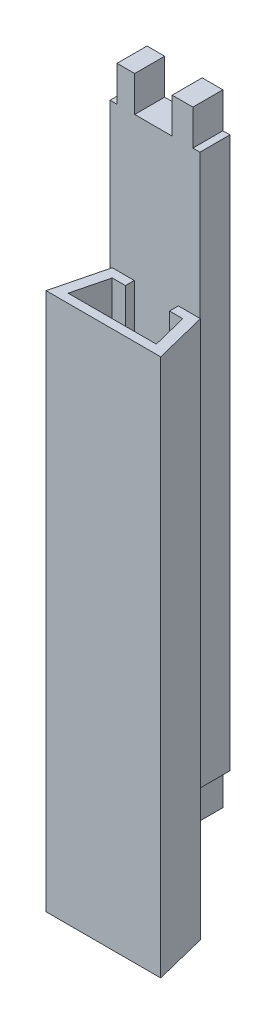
ISO-10303-21;
HEADER;
FILE_DESCRIPTION(('STEP AP214'),'2;1');
FILE_NAME('part.step','',(''),(''),'','','');
FILE_SCHEMA(('AUTOMOTIVE_DESIGN { 1 0 10303 214 1 1 1 1 }'));
ENDSEC;
DATA;
#1=APPLICATION_CONTEXT('core data for automotive mechanical design processes');
#2=APPLICATION_PROTOCOL_DEFINITION('international standard','automotive_design',2000,#1);
#3=PRODUCT_CONTEXT('',#1,'mechanical');
#4=PRODUCT('Part','Part','',(#3));
#5=PRODUCT_RELATED_PRODUCT_CATEGORY('part','',(#4));
#6=PRODUCT_DEFINITION_FORMATION('','',#4);
#7=PRODUCT_DEFINITION_CONTEXT('part definition',#1,'design');
#8=PRODUCT_DEFINITION('design','',#6,#7);
#9=PRODUCT_DEFINITION_SHAPE('','',#8);
#10=(LENGTH_UNIT() NAMED_UNIT(*) SI_UNIT(.MILLI.,.METRE.));
#11=(NAMED_UNIT(*) PLANE_ANGLE_UNIT() SI_UNIT($,.RADIAN.));
#12=(NAMED_UNIT(*) SI_UNIT($,.STERADIAN.) SOLID_ANGLE_UNIT());
#13=UNCERTAINTY_MEASURE_WITH_UNIT(LENGTH_MEASURE(1.E-05),#10,'distance_accuracy_value','');
#14=(GEOMETRIC_REPRESENTATION_CONTEXT(3) GLOBAL_UNCERTAINTY_ASSIGNED_CONTEXT((#13)) GLOBAL_UNIT_ASSIGNED_CONTEXT((#10,
#11,#12)) REPRESENTATION_CONTEXT('',''));
#15=CARTESIAN_POINT('',(0.,0.,0.));
#16=DIRECTION('',(0.,0.,1.));
#17=DIRECTION('',(1.,0.,0.));
#18=AXIS2_PLACEMENT_3D('',#15,#16,#17);
#19=CARTESIAN_POINT('',(-118.6,124.95,147.8));
#20=DIRECTION('',(0.,1.,0.));
#21=DIRECTION('',(0.,0.,1.));
#22=AXIS2_PLACEMENT_3D('',#19,#20,#21);
#23=PLANE('',#22);
#24=DIRECTION('',(1.,0.,0.));
#25=VECTOR('',#24,1.);
#26=CARTESIAN_POINT('',(-118.6,124.95,147.8));
#27=LINE('',#26,#25);
#28=CARTESIAN_POINT('',(-119.4,124.95,147.8));
#29=VERTEX_POINT('',#28);
#30=CARTESIAN_POINT('',(-117.8,124.95,147.8));
#31=VERTEX_POINT('',#30);
#32=EDGE_CURVE('P0_E20',#29,#31,#27,.T.);
#33=ORIENTED_EDGE('',*,*,#32,.T.);
#34=DIRECTION('',(0.,0.,-1.));
#35=VECTOR('',#34,1.);
#36=CARTESIAN_POINT('',(-117.8,124.95,147.8));
#37=LINE('',#36,#35);
#38=CARTESIAN_POINT('',(-117.8,124.95,141.));
#39=VERTEX_POINT('',#38);
#40=EDGE_CURVE('P0_E170',#39,#31,#37,.F.);
#41=ORIENTED_EDGE('',*,*,#40,.F.);
#42=DIRECTION('',(-1.,0.,0.));
#43=VECTOR('',#42,1.);
#44=CARTESIAN_POINT('',(-128.,124.95,141.));
#45=LINE('',#44,#43);
#46=CARTESIAN_POINT('',(-119.4,124.95,141.));
#47=VERTEX_POINT('',#46);
#48=EDGE_CURVE('P0_E151',#47,#39,#45,.F.);
#49=ORIENTED_EDGE('',*,*,#48,.F.);
#50=DIRECTION('',(0.,0.,-1.));
#51=VECTOR('',#50,1.);
#52=CARTESIAN_POINT('',(-119.4,124.95,147.8));
#53=LINE('',#52,#51);
#54=EDGE_CURVE('P0_E174',#29,#47,#53,.T.);
#55=ORIENTED_EDGE('',*,*,#54,.F.);
#56=EDGE_LOOP('',(#33,#41,#49,#55));
#57=FACE_BOUND('',#56,.T.);
#58=ADVANCED_FACE('P0_F17',(#57),#23,.T.);
#59=CARTESIAN_POINT('',(-118.6,0.0500000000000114,147.8));
#60=DIRECTION('',(0.,-1.,0.));
#61=DIRECTION('',(0.,0.,-1.));
#62=AXIS2_PLACEMENT_3D('',#59,#60,#61);
#63=PLANE('',#62);
#64=DIRECTION('',(1.,0.,0.));
#65=VECTOR('',#64,1.);
#66=CARTESIAN_POINT('',(-118.6,0.0500000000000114,147.8));
#67=LINE('',#66,#65);
#68=CARTESIAN_POINT('',(-117.8,0.0500000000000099,147.8));
#69=VERTEX_POINT('',#68);
#70=CARTESIAN_POINT('',(-119.4,0.0500000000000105,147.8));
#71=VERTEX_POINT('',#70);
#72=EDGE_CURVE('P0_E190',#69,#71,#67,.F.);
#73=ORIENTED_EDGE('',*,*,#72,.T.);
#74=DIRECTION('',(0.,0.,-1.));
#75=VECTOR('',#74,1.);
#76=CARTESIAN_POINT('',(-119.4,0.050000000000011,147.8));
#77=LINE('',#76,#75);
#78=CARTESIAN_POINT('',(-119.4,0.0500000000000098,141.));
#79=VERTEX_POINT('',#78);
#80=EDGE_CURVE('P0_E195',#79,#71,#77,.F.);
#81=ORIENTED_EDGE('',*,*,#80,.F.);
#82=DIRECTION('',(-1.,0.,0.));
#83=VECTOR('',#82,1.);
#84=CARTESIAN_POINT('',(-128.,0.0500000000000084,141.));
#85=LINE('',#84,#83);
#86=CARTESIAN_POINT('',(-117.8,0.0500000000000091,141.));
#87=VERTEX_POINT('',#86);
#88=EDGE_CURVE('P0_E162',#87,#79,#85,.T.);
#89=ORIENTED_EDGE('',*,*,#88,.F.);
#90=DIRECTION('',(0.,0.,-1.));
#91=VECTOR('',#90,1.);
#92=CARTESIAN_POINT('',(-117.8,0.0500000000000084,147.8));
#93=LINE('',#92,#91);
#94=EDGE_CURVE('P0_E173',#69,#87,#93,.T.);
#95=ORIENTED_EDGE('',*,*,#94,.F.);
#96=EDGE_LOOP('',(#73,#81,#89,#95));
#97=FACE_BOUND('',#96,.T.);
#98=ADVANCED_FACE('P0_F194',(#97),#63,.T.);
#99=CARTESIAN_POINT('',(-137.4,0.0500000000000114,147.8));
#100=DIRECTION('',(0.,-1.,0.));
#101=DIRECTION('',(0.,0.,-1.));
#102=AXIS2_PLACEMENT_3D('',#99,#100,#101);
#103=PLANE('',#102);
#104=DIRECTION('',(1.,0.,0.));
#105=VECTOR('',#104,1.);
#106=CARTESIAN_POINT('',(-137.4,0.0500000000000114,147.8));
#107=LINE('',#106,#105);
#108=CARTESIAN_POINT('',(-136.6,0.0500000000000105,147.8));
#109=VERTEX_POINT('',#108);
#110=CARTESIAN_POINT('',(-138.2,0.0500000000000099,147.8));
#111=VERTEX_POINT('',#110);
#112=EDGE_CURVE('P0_E189',#109,#111,#107,.F.);
#113=ORIENTED_EDGE('',*,*,#112,.T.);
#114=DIRECTION('',(0.,0.,1.));
#115=VECTOR('',#114,1.);
#116=CARTESIAN_POINT('',(-138.2,0.0500000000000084,147.8));
#117=LINE('',#116,#115);
#118=CARTESIAN_POINT('',(-138.2,0.0500000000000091,141.));
#119=VERTEX_POINT('',#118);
#120=EDGE_CURVE('P0_E254',#119,#111,#117,.T.);
#121=ORIENTED_EDGE('',*,*,#120,.F.);
#122=DIRECTION('',(-1.,0.,0.));
#123=VECTOR('',#122,1.);
#124=CARTESIAN_POINT('',(-128.,0.0500000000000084,141.));
#125=LINE('',#124,#123);
#126=CARTESIAN_POINT('',(-136.6,0.0500000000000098,141.));
#127=VERTEX_POINT('',#126);
#128=EDGE_CURVE('P0_E185',#127,#119,#125,.T.);
#129=ORIENTED_EDGE('',*,*,#128,.F.);
#130=DIRECTION('',(0.,0.,1.));
#131=VECTOR('',#130,1.);
#132=CARTESIAN_POINT('',(-136.6,0.050000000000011,147.8));
#133=LINE('',#132,#131);
#134=EDGE_CURVE('P0_E260',#109,#127,#133,.F.);
#135=ORIENTED_EDGE('',*,*,#134,.F.);
#136=EDGE_LOOP('',(#113,#121,#129,#135));
#137=FACE_BOUND('',#136,.T.);
#138=ADVANCED_FACE('P0_F362',(#137),#103,.T.);
#139=CARTESIAN_POINT('',(-137.4,124.95,147.8));
#140=DIRECTION('',(0.,1.,0.));
#141=DIRECTION('',(0.,0.,1.));
#142=AXIS2_PLACEMENT_3D('',#139,#140,#141);
#143=PLANE('',#142);
#144=DIRECTION('',(1.,0.,0.));
#145=VECTOR('',#144,1.);
#146=CARTESIAN_POINT('',(-137.4,124.95,147.8));
#147=LINE('',#146,#145);
#148=CARTESIAN_POINT('',(-138.2,124.95,147.8));
#149=VERTEX_POINT('',#148);
#150=CARTESIAN_POINT('',(-136.6,124.95,147.8));
#151=VERTEX_POINT('',#150);
#152=EDGE_CURVE('P0_E163',#149,#151,#147,.T.);
#153=ORIENTED_EDGE('',*,*,#152,.T.);
#154=DIRECTION('',(0.,0.,1.));
#155=VECTOR('',#154,1.);
#156=CARTESIAN_POINT('',(-136.6,124.95,147.8));
#157=LINE('',#156,#155);
#158=CARTESIAN_POINT('',(-136.6,124.95,141.));
#159=VERTEX_POINT('',#158);
#160=EDGE_CURVE('P0_E245',#159,#151,#157,.T.);
#161=ORIENTED_EDGE('',*,*,#160,.F.);
#162=DIRECTION('',(-1.,0.,0.));
#163=VECTOR('',#162,1.);
#164=CARTESIAN_POINT('',(-128.,124.95,141.));
#165=LINE('',#164,#163);
#166=CARTESIAN_POINT('',(-138.2,124.95,141.));
#167=VERTEX_POINT('',#166);
#168=EDGE_CURVE('P0_E183',#167,#159,#165,.F.);
#169=ORIENTED_EDGE('',*,*,#168,.F.);
#170=DIRECTION('',(0.,0.,1.));
#171=VECTOR('',#170,1.);
#172=CARTESIAN_POINT('',(-138.2,124.95,147.8));
#173=LINE('',#172,#171);
#174=EDGE_CURVE('P0_E251',#149,#167,#173,.F.);
#175=ORIENTED_EDGE('',*,*,#174,.F.);
#176=EDGE_LOOP('',(#153,#161,#169,#175));
#177=FACE_BOUND('',#176,.T.);
#178=ADVANCED_FACE('P0_F356',(#177),#143,.T.);
#179=CARTESIAN_POINT('',(-128.,62.5,141.));
#180=DIRECTION('',(0.,0.,-1.));
#181=DIRECTION('',(-1.,0.,0.));
#182=AXIS2_PLACEMENT_3D('',#179,#180,#181);
#183=PLANE('',#182);
#184=DIRECTION('',(0.,1.,0.));
#185=VECTOR('',#184,1.);
#186=CARTESIAN_POINT('',(-132.6,128.975,141.));
#187=LINE('',#186,#185);
#188=CARTESIAN_POINT('',(-132.6,124.95,141.));
#189=VERTEX_POINT('',#188);
#190=CARTESIAN_POINT('',(-132.6,133.,141.));
#191=VERTEX_POINT('',#190);
#192=EDGE_CURVE('P0_E239',#189,#191,#187,.T.);
#193=ORIENTED_EDGE('',*,*,#192,.F.);
#194=DIRECTION('',(1.,0.,0.));
#195=VECTOR('',#194,1.);
#196=CARTESIAN_POINT('',(-128.35,124.95,141.));
#197=LINE('',#196,#195);
#198=CARTESIAN_POINT('',(-124.1,124.95,141.));
#199=VERTEX_POINT('',#198);
#200=EDGE_CURVE('P0_E235',#199,#189,#197,.F.);
#201=ORIENTED_EDGE('',*,*,#200,.F.);
#202=DIRECTION('',(0.,1.,0.));
#203=VECTOR('',#202,1.);
#204=CARTESIAN_POINT('',(-124.1,128.975,141.));
#205=LINE('',#204,#203);
#206=CARTESIAN_POINT('',(-124.1,133.,141.));
#207=VERTEX_POINT('',#206);
#208=EDGE_CURVE('P0_E231',#207,#199,#205,.F.);
#209=ORIENTED_EDGE('',*,*,#208,.F.);
#210=DIRECTION('',(1.,0.,0.));
#211=VECTOR('',#210,1.);
#212=CARTESIAN_POINT('',(-121.75,133.,141.));
#213=LINE('',#212,#211);
#214=CARTESIAN_POINT('',(-119.4,133.,141.));
#215=VERTEX_POINT('',#214);
#216=EDGE_CURVE('P0_E227',#215,#207,#213,.F.);
#217=ORIENTED_EDGE('',*,*,#216,.F.);
#218=DIRECTION('',(0.,1.,0.));
#219=VECTOR('',#218,1.);
#220=CARTESIAN_POINT('',(-119.4,128.975,141.));
#221=LINE('',#220,#219);
#222=EDGE_CURVE('P0_E157',#47,#215,#221,.T.);
#223=ORIENTED_EDGE('',*,*,#222,.F.);
#224=ORIENTED_EDGE('',*,*,#48,.T.);
#225=DIRECTION('',(0.,1.,0.));
#226=VECTOR('',#225,1.);
#227=CARTESIAN_POINT('',(-117.8,62.5,141.));
#228=LINE('',#227,#226);
#229=EDGE_CURVE('P0_E155',#87,#39,#228,.T.);
#230=ORIENTED_EDGE('',*,*,#229,.F.);
#231=ORIENTED_EDGE('',*,*,#88,.T.);
#232=DIRECTION('',(0.,1.,0.));
#233=VECTOR('',#232,1.);
#234=CARTESIAN_POINT('',(-119.4,-3.97499999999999,141.));
#235=LINE('',#234,#233);
#236=CARTESIAN_POINT('',(-119.4,-8.,141.));
#237=VERTEX_POINT('',#236);
#238=EDGE_CURVE('P0_E177',#237,#79,#235,.T.);
#239=ORIENTED_EDGE('',*,*,#238,.F.);
#240=DIRECTION('',(1.,0.,0.));
#241=VECTOR('',#240,1.);
#242=CARTESIAN_POINT('',(-121.4,-8.,141.));
#243=LINE('',#242,#241);
#244=CARTESIAN_POINT('',(-123.4,-8.,141.));
#245=VERTEX_POINT('',#244);
#246=EDGE_CURVE('P0_E205',#245,#237,#243,.T.);
#247=ORIENTED_EDGE('',*,*,#246,.F.);
#248=DIRECTION('',(0.,1.,0.));
#249=VECTOR('',#248,1.);
#250=CARTESIAN_POINT('',(-123.4,-3.97499999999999,141.));
#251=LINE('',#250,#249);
#252=CARTESIAN_POINT('',(-123.4,0.0500000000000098,141.));
#253=VERTEX_POINT('',#252);
#254=EDGE_CURVE('P0_E281',#253,#245,#251,.F.);
#255=ORIENTED_EDGE('',*,*,#254,.F.);
#256=DIRECTION('',(1.,0.,0.));
#257=VECTOR('',#256,1.);
#258=CARTESIAN_POINT('',(-127.65,0.0500000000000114,141.));
#259=LINE('',#258,#257);
#260=CARTESIAN_POINT('',(-131.9,0.0500000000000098,141.));
#261=VERTEX_POINT('',#260);
#262=EDGE_CURVE('P0_E277',#261,#253,#259,.T.);
#263=ORIENTED_EDGE('',*,*,#262,.F.);
#264=DIRECTION('',(0.,1.,0.));
#265=VECTOR('',#264,1.);
#266=CARTESIAN_POINT('',(-131.9,-3.97499999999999,141.));
#267=LINE('',#266,#265);
#268=CARTESIAN_POINT('',(-131.9,-8.,141.));
#269=VERTEX_POINT('',#268);
#270=EDGE_CURVE('P0_E273',#269,#261,#267,.T.);
#271=ORIENTED_EDGE('',*,*,#270,.F.);
#272=DIRECTION('',(1.,0.,0.));
#273=VECTOR('',#272,1.);
#274=CARTESIAN_POINT('',(-134.25,-8.,141.));
#275=LINE('',#274,#273);
#276=CARTESIAN_POINT('',(-136.6,-8.,141.));
#277=VERTEX_POINT('',#276);
#278=EDGE_CURVE('P0_E269',#277,#269,#275,.T.);
#279=ORIENTED_EDGE('',*,*,#278,.F.);
#280=DIRECTION('',(0.,1.,0.));
#281=VECTOR('',#280,1.);
#282=CARTESIAN_POINT('',(-136.6,-3.97499999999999,141.));
#283=LINE('',#282,#281);
#284=EDGE_CURVE('P0_E265',#127,#277,#283,.F.);
#285=ORIENTED_EDGE('',*,*,#284,.F.);
#286=ORIENTED_EDGE('',*,*,#128,.T.);
#287=DIRECTION('',(0.,1.,0.));
#288=VECTOR('',#287,1.);
#289=CARTESIAN_POINT('',(-138.2,62.5,141.));
#290=LINE('',#289,#288);
#291=EDGE_CURVE('P0_E257',#167,#119,#290,.F.);
#292=ORIENTED_EDGE('',*,*,#291,.F.);
#293=ORIENTED_EDGE('',*,*,#168,.T.);
#294=DIRECTION('',(0.,1.,0.));
#295=VECTOR('',#294,1.);
#296=CARTESIAN_POINT('',(-136.6,128.975,141.));
#297=LINE('',#296,#295);
#298=CARTESIAN_POINT('',(-136.6,133.,141.));
#299=VERTEX_POINT('',#298);
#300=EDGE_CURVE('P0_E248',#299,#159,#297,.F.);
#301=ORIENTED_EDGE('',*,*,#300,.F.);
#302=DIRECTION('',(1.,0.,0.));
#303=VECTOR('',#302,1.);
#304=CARTESIAN_POINT('',(-134.6,133.,141.));
#305=LINE('',#304,#303);
#306=EDGE_CURVE('P0_E243',#191,#299,#305,.F.);
#307=ORIENTED_EDGE('',*,*,#306,.F.);
#308=EDGE_LOOP('',(#193,#201,#209,#217,#223,#224,#230,#231,#239,#247,#255,#263,#271,#279,#285,
#286,#292,#293,#301,#307));
#309=FACE_BOUND('',#308,.T.);
#310=ADVANCED_FACE('P0_F154',(#309),#183,.T.);
#311=CARTESIAN_POINT('',(-119.4,128.975,147.8));
#312=DIRECTION('',(1.,0.,0.));
#313=DIRECTION('',(0.,0.,-1.));
#314=AXIS2_PLACEMENT_3D('',#311,#312,#313);
#315=PLANE('',#314);
#316=DIRECTION('',(0.,1.,0.));
#317=VECTOR('',#316,1.);
#318=CARTESIAN_POINT('',(-119.4,62.5,147.8));
#319=LINE('',#318,#317);
#320=CARTESIAN_POINT('',(-119.4,133.,147.8));
#321=VERTEX_POINT('',#320);
#322=EDGE_CURVE('P0_E217',#321,#29,#319,.F.);
#323=ORIENTED_EDGE('',*,*,#322,.T.);
#324=ORIENTED_EDGE('',*,*,#54,.T.);
#325=ORIENTED_EDGE('',*,*,#222,.T.);
#326=DIRECTION('',(0.,0.,1.));
#327=VECTOR('',#326,1.);
#328=CARTESIAN_POINT('',(-119.4,133.,147.8));
#329=LINE('',#328,#327);
#330=EDGE_CURVE('P0_E223',#321,#215,#329,.F.);
#331=ORIENTED_EDGE('',*,*,#330,.F.);
#332=EDGE_LOOP('',(#323,#324,#325,#331));
#333=FACE_BOUND('',#332,.T.);
#334=ADVANCED_FACE('P0_F504',(#333),#315,.T.);
#335=CARTESIAN_POINT('',(-117.8,62.5,147.8));
#336=DIRECTION('',(1.,0.,0.));
#337=DIRECTION('',(0.,0.,-1.));
#338=AXIS2_PLACEMENT_3D('',#335,#336,#337);
#339=PLANE('',#338);
#340=DIRECTION('',(0.,1.,0.));
#341=VECTOR('',#340,1.);
#342=CARTESIAN_POINT('',(-117.8,62.5,147.8));
#343=LINE('',#342,#341);
#344=EDGE_CURVE('P0_E213',#31,#69,#343,.F.);
#345=ORIENTED_EDGE('',*,*,#344,.T.);
#346=ORIENTED_EDGE('',*,*,#94,.T.);
#347=ORIENTED_EDGE('',*,*,#229,.T.);
#348=ORIENTED_EDGE('',*,*,#40,.T.);
#349=EDGE_LOOP('',(#345,#346,#347,#348));
#350=FACE_BOUND('',#349,.T.);
#351=ADVANCED_FACE('P0_F169',(#350),#339,.T.);
#352=CARTESIAN_POINT('',(-119.4,-3.97499999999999,147.8));
#353=DIRECTION('',(1.,0.,0.));
#354=DIRECTION('',(0.,0.,-1.));
#355=AXIS2_PLACEMENT_3D('',#352,#353,#354);
#356=PLANE('',#355);
#357=DIRECTION('',(0.,1.,0.));
#358=VECTOR('',#357,1.);
#359=CARTESIAN_POINT('',(-119.4,62.5,147.8));
#360=LINE('',#359,#358);
#361=CARTESIAN_POINT('',(-119.4,-8.,147.8));
#362=VERTEX_POINT('',#361);
#363=EDGE_CURVE('P0_E203',#71,#362,#360,.F.);
#364=ORIENTED_EDGE('',*,*,#363,.T.);
#365=DIRECTION('',(0.,0.,-1.));
#366=VECTOR('',#365,1.);
#367=CARTESIAN_POINT('',(-119.4,-8.,147.8));
#368=LINE('',#367,#366);
#369=EDGE_CURVE('P0_E283',#237,#362,#368,.F.);
#370=ORIENTED_EDGE('',*,*,#369,.F.);
#371=ORIENTED_EDGE('',*,*,#238,.T.);
#372=ORIENTED_EDGE('',*,*,#80,.T.);
#373=EDGE_LOOP('',(#364,#370,#371,#372));
#374=FACE_BOUND('',#373,.T.);
#375=ADVANCED_FACE('P0_F201',(#374),#356,.T.);
#376=CARTESIAN_POINT('',(-121.4,-8.,147.8));
#377=DIRECTION('',(0.,-1.,0.));
#378=DIRECTION('',(0.,0.,-1.));
#379=AXIS2_PLACEMENT_3D('',#376,#377,#378);
#380=PLANE('',#379);
#381=DIRECTION('',(-1.,0.,0.));
#382=VECTOR('',#381,1.);
#383=CARTESIAN_POINT('',(-128.,-8.00000000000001,147.8));
#384=LINE('',#383,#382);
#385=CARTESIAN_POINT('',(-123.4,-8.,147.8));
#386=VERTEX_POINT('',#385);
#387=EDGE_CURVE('P0_E212',#362,#386,#384,.T.);
#388=ORIENTED_EDGE('',*,*,#387,.T.);
#389=DIRECTION('',(0.,0.,1.));
#390=VECTOR('',#389,1.);
#391=CARTESIAN_POINT('',(-123.4,-8.,147.8));
#392=LINE('',#391,#390);
#393=EDGE_CURVE('P0_E279',#245,#386,#392,.T.);
#394=ORIENTED_EDGE('',*,*,#393,.F.);
#395=ORIENTED_EDGE('',*,*,#246,.T.);
#396=ORIENTED_EDGE('',*,*,#369,.T.);
#397=EDGE_LOOP('',(#388,#394,#395,#396));
#398=FACE_BOUND('',#397,.T.);
#399=ADVANCED_FACE('P0_F288',(#398),#380,.T.);
#400=CARTESIAN_POINT('',(-123.4,-3.97499999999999,147.8));
#401=DIRECTION('',(-1.,0.,0.));
#402=DIRECTION('',(0.,0.,1.));
#403=AXIS2_PLACEMENT_3D('',#400,#401,#402);
#404=PLANE('',#403);
#405=DIRECTION('',(0.,1.,0.));
#406=VECTOR('',#405,1.);
#407=CARTESIAN_POINT('',(-123.4,62.5,147.8));
#408=LINE('',#407,#406);
#409=CARTESIAN_POINT('',(-123.4,0.0500000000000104,147.8));
#410=VERTEX_POINT('',#409);
#411=EDGE_CURVE('P0_E215',#386,#410,#408,.T.);
#412=ORIENTED_EDGE('',*,*,#411,.T.);
#413=DIRECTION('',(0.,0.,-1.));
#414=VECTOR('',#413,1.);
#415=CARTESIAN_POINT('',(-123.4,0.0500000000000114,147.8));
#416=LINE('',#415,#414);
#417=EDGE_CURVE('P0_E275',#253,#410,#416,.F.);
#418=ORIENTED_EDGE('',*,*,#417,.F.);
#419=ORIENTED_EDGE('',*,*,#254,.T.);
#420=ORIENTED_EDGE('',*,*,#393,.T.);
#421=EDGE_LOOP('',(#412,#418,#419,#420));
#422=FACE_BOUND('',#421,.T.);
#423=ADVANCED_FACE('P0_F296',(#422),#404,.T.);
#424=CARTESIAN_POINT('',(-127.65,0.0500000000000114,147.8));
#425=DIRECTION('',(0.,-1.,0.));
#426=DIRECTION('',(0.,0.,-1.));
#427=AXIS2_PLACEMENT_3D('',#424,#425,#426);
#428=PLANE('',#427);
#429=DIRECTION('',(-1.,0.,0.));
#430=VECTOR('',#429,1.);
#431=CARTESIAN_POINT('',(-128.,0.0500000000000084,147.8));
#432=LINE('',#431,#430);
#433=CARTESIAN_POINT('',(-131.9,0.0500000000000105,147.8));
#434=VERTEX_POINT('',#433);
#435=EDGE_CURVE('P0_E301',#410,#434,#432,.T.);
#436=ORIENTED_EDGE('',*,*,#435,.T.);
#437=DIRECTION('',(0.,0.,-1.));
#438=VECTOR('',#437,1.);
#439=CARTESIAN_POINT('',(-131.9,0.050000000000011,147.8));
#440=LINE('',#439,#438);
#441=EDGE_CURVE('P0_E271',#261,#434,#440,.F.);
#442=ORIENTED_EDGE('',*,*,#441,.F.);
#443=ORIENTED_EDGE('',*,*,#262,.T.);
#444=ORIENTED_EDGE('',*,*,#417,.T.);
#445=EDGE_LOOP('',(#436,#442,#443,#444));
#446=FACE_BOUND('',#445,.T.);
#447=ADVANCED_FACE('P0_F300',(#446),#428,.T.);
#448=CARTESIAN_POINT('',(-131.9,-3.97499999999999,147.8));
#449=DIRECTION('',(1.,0.,0.));
#450=DIRECTION('',(0.,0.,-1.));
#451=AXIS2_PLACEMENT_3D('',#448,#449,#450);
#452=PLANE('',#451);
#453=DIRECTION('',(0.,1.,0.));
#454=VECTOR('',#453,1.);
#455=CARTESIAN_POINT('',(-131.9,62.5,147.8));
#456=LINE('',#455,#454);
#457=CARTESIAN_POINT('',(-131.9,-8.,147.8));
#458=VERTEX_POINT('',#457);
#459=EDGE_CURVE('P0_E305',#434,#458,#456,.F.);
#460=ORIENTED_EDGE('',*,*,#459,.T.);
#461=DIRECTION('',(0.,0.,-1.));
#462=VECTOR('',#461,1.);
#463=CARTESIAN_POINT('',(-131.9,-8.,147.8));
#464=LINE('',#463,#462);
#465=EDGE_CURVE('P0_E267',#269,#458,#464,.F.);
#466=ORIENTED_EDGE('',*,*,#465,.F.);
#467=ORIENTED_EDGE('',*,*,#270,.T.);
#468=ORIENTED_EDGE('',*,*,#441,.T.);
#469=EDGE_LOOP('',(#460,#466,#467,#468));
#470=FACE_BOUND('',#469,.T.);
#471=ADVANCED_FACE('P0_F372',(#470),#452,.T.);
#472=CARTESIAN_POINT('',(-134.25,-8.,147.8));
#473=DIRECTION('',(0.,-1.,0.));
#474=DIRECTION('',(0.,0.,-1.));
#475=AXIS2_PLACEMENT_3D('',#472,#473,#474);
#476=PLANE('',#475);
#477=DIRECTION('',(-1.,0.,0.));
#478=VECTOR('',#477,1.);
#479=CARTESIAN_POINT('',(-128.,-8.00000000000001,147.8));
#480=LINE('',#479,#478);
#481=CARTESIAN_POINT('',(-136.6,-8.,147.8));
#482=VERTEX_POINT('',#481);
#483=EDGE_CURVE('P0_E307',#458,#482,#480,.T.);
#484=ORIENTED_EDGE('',*,*,#483,.T.);
#485=DIRECTION('',(0.,0.,1.));
#486=VECTOR('',#485,1.);
#487=CARTESIAN_POINT('',(-136.6,-8.,147.8));
#488=LINE('',#487,#486);
#489=EDGE_CURVE('P0_E263',#277,#482,#488,.T.);
#490=ORIENTED_EDGE('',*,*,#489,.F.);
#491=ORIENTED_EDGE('',*,*,#278,.T.);
#492=ORIENTED_EDGE('',*,*,#465,.T.);
#493=EDGE_LOOP('',(#484,#490,#491,#492));
#494=FACE_BOUND('',#493,.T.);
#495=ADVANCED_FACE('P0_F368',(#494),#476,.T.);
#496=CARTESIAN_POINT('',(-136.6,-3.97499999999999,147.8));
#497=DIRECTION('',(-1.,0.,0.));
#498=DIRECTION('',(0.,0.,1.));
#499=AXIS2_PLACEMENT_3D('',#496,#497,#498);
#500=PLANE('',#499);
#501=DIRECTION('',(0.,1.,0.));
#502=VECTOR('',#501,1.);
#503=CARTESIAN_POINT('',(-136.6,62.5,147.8));
#504=LINE('',#503,#502);
#505=EDGE_CURVE('P0_E312',#482,#109,#504,.T.);
#506=ORIENTED_EDGE('',*,*,#505,.T.);
#507=ORIENTED_EDGE('',*,*,#134,.T.);
#508=ORIENTED_EDGE('',*,*,#284,.T.);
#509=ORIENTED_EDGE('',*,*,#489,.T.);
#510=EDGE_LOOP('',(#506,#507,#508,#509));
#511=FACE_BOUND('',#510,.T.);
#512=ADVANCED_FACE('P0_F374',(#511),#500,.T.);
#513=CARTESIAN_POINT('',(-138.2,62.5,147.8));
#514=DIRECTION('',(-1.,0.,0.));
#515=DIRECTION('',(0.,0.,1.));
#516=AXIS2_PLACEMENT_3D('',#513,#514,#515);
#517=PLANE('',#516);
#518=DIRECTION('',(0.,1.,0.));
#519=VECTOR('',#518,1.);
#520=CARTESIAN_POINT('',(-138.2,62.5,147.8));
#521=LINE('',#520,#519);
#522=EDGE_CURVE('P0_E315',#111,#149,#521,.T.);
#523=ORIENTED_EDGE('',*,*,#522,.T.);
#524=ORIENTED_EDGE('',*,*,#174,.T.);
#525=ORIENTED_EDGE('',*,*,#291,.T.);
#526=ORIENTED_EDGE('',*,*,#120,.T.);
#527=EDGE_LOOP('',(#523,#524,#525,#526));
#528=FACE_BOUND('',#527,.T.);
#529=ADVANCED_FACE('P0_F359',(#528),#517,.T.);
#530=CARTESIAN_POINT('',(-136.6,128.975,147.8));
#531=DIRECTION('',(-1.,0.,0.));
#532=DIRECTION('',(0.,0.,1.));
#533=AXIS2_PLACEMENT_3D('',#530,#531,#532);
#534=PLANE('',#533);
#535=DIRECTION('',(0.,1.,0.));
#536=VECTOR('',#535,1.);
#537=CARTESIAN_POINT('',(-136.6,62.5,147.8));
#538=LINE('',#537,#536);
#539=CARTESIAN_POINT('',(-136.6,133.,147.8));
#540=VERTEX_POINT('',#539);
#541=EDGE_CURVE('P0_E318',#151,#540,#538,.T.);
#542=ORIENTED_EDGE('',*,*,#541,.T.);
#543=DIRECTION('',(0.,0.,1.));
#544=VECTOR('',#543,1.);
#545=CARTESIAN_POINT('',(-136.6,133.,147.8));
#546=LINE('',#545,#544);
#547=EDGE_CURVE('P0_E241',#299,#540,#546,.T.);
#548=ORIENTED_EDGE('',*,*,#547,.F.);
#549=ORIENTED_EDGE('',*,*,#300,.T.);
#550=ORIENTED_EDGE('',*,*,#160,.T.);
#551=EDGE_LOOP('',(#542,#548,#549,#550));
#552=FACE_BOUND('',#551,.T.);
#553=ADVANCED_FACE('P0_F351',(#552),#534,.T.);
#554=CARTESIAN_POINT('',(-134.6,133.,147.8));
#555=DIRECTION('',(0.,1.,0.));
#556=DIRECTION('',(0.,0.,1.));
#557=AXIS2_PLACEMENT_3D('',#554,#555,#556);
#558=PLANE('',#557);
#559=DIRECTION('',(-1.,0.,0.));
#560=VECTOR('',#559,1.);
#561=CARTESIAN_POINT('',(-128.,133.,147.8));
#562=LINE('',#561,#560);
#563=CARTESIAN_POINT('',(-132.6,133.,147.8));
#564=VERTEX_POINT('',#563);
#565=EDGE_CURVE('P0_E321',#540,#564,#562,.F.);
#566=ORIENTED_EDGE('',*,*,#565,.T.);
#567=DIRECTION('',(0.,0.,-1.));
#568=VECTOR('',#567,1.);
#569=CARTESIAN_POINT('',(-132.6,133.,147.8));
#570=LINE('',#569,#568);
#571=EDGE_CURVE('P0_E237',#191,#564,#570,.F.);
#572=ORIENTED_EDGE('',*,*,#571,.F.);
#573=ORIENTED_EDGE('',*,*,#306,.T.);
#574=ORIENTED_EDGE('',*,*,#547,.T.);
#575=EDGE_LOOP('',(#566,#572,#573,#574));
#576=FACE_BOUND('',#575,.T.);
#577=ADVANCED_FACE('P0_F347',(#576),#558,.T.);
#578=CARTESIAN_POINT('',(-132.6,128.975,147.8));
#579=DIRECTION('',(1.,0.,0.));
#580=DIRECTION('',(0.,0.,-1.));
#581=AXIS2_PLACEMENT_3D('',#578,#579,#580);
#582=PLANE('',#581);
#583=DIRECTION('',(0.,1.,0.));
#584=VECTOR('',#583,1.);
#585=CARTESIAN_POINT('',(-132.6,62.5,147.8));
#586=LINE('',#585,#584);
#587=CARTESIAN_POINT('',(-132.6,124.95,147.8));
#588=VERTEX_POINT('',#587);
#589=EDGE_CURVE('P0_E324',#564,#588,#586,.F.);
#590=ORIENTED_EDGE('',*,*,#589,.T.);
#591=DIRECTION('',(0.,0.,1.));
#592=VECTOR('',#591,1.);
#593=CARTESIAN_POINT('',(-132.6,124.95,147.8));
#594=LINE('',#593,#592);
#595=EDGE_CURVE('P0_E233',#189,#588,#594,.T.);
#596=ORIENTED_EDGE('',*,*,#595,.F.);
#597=ORIENTED_EDGE('',*,*,#192,.T.);
#598=ORIENTED_EDGE('',*,*,#571,.T.);
#599=EDGE_LOOP('',(#590,#596,#597,#598));
#600=FACE_BOUND('',#599,.T.);
#601=ADVANCED_FACE('P0_F341',(#600),#582,.T.);
#602=CARTESIAN_POINT('',(-128.35,124.95,147.8));
#603=DIRECTION('',(0.,1.,0.));
#604=DIRECTION('',(0.,0.,1.));
#605=AXIS2_PLACEMENT_3D('',#602,#603,#604);
#606=PLANE('',#605);
#607=DIRECTION('',(-1.,0.,0.));
#608=VECTOR('',#607,1.);
#609=CARTESIAN_POINT('',(-128.,124.95,147.8));
#610=LINE('',#609,#608);
#611=CARTESIAN_POINT('',(-124.1,124.95,147.8));
#612=VERTEX_POINT('',#611);
#613=EDGE_CURVE('P0_E327',#588,#612,#610,.F.);
#614=ORIENTED_EDGE('',*,*,#613,.T.);
#615=DIRECTION('',(0.,0.,1.));
#616=VECTOR('',#615,1.);
#617=CARTESIAN_POINT('',(-124.1,124.95,147.8));
#618=LINE('',#617,#616);
#619=EDGE_CURVE('P0_E229',#199,#612,#618,.T.);
#620=ORIENTED_EDGE('',*,*,#619,.F.);
#621=ORIENTED_EDGE('',*,*,#200,.T.);
#622=ORIENTED_EDGE('',*,*,#595,.T.);
#623=EDGE_LOOP('',(#614,#620,#621,#622));
#624=FACE_BOUND('',#623,.T.);
#625=ADVANCED_FACE('P0_F337',(#624),#606,.T.);
#626=CARTESIAN_POINT('',(-124.1,128.975,147.8));
#627=DIRECTION('',(-1.,0.,0.));
#628=DIRECTION('',(0.,0.,1.));
#629=AXIS2_PLACEMENT_3D('',#626,#627,#628);
#630=PLANE('',#629);
#631=DIRECTION('',(0.,1.,0.));
#632=VECTOR('',#631,1.);
#633=CARTESIAN_POINT('',(-124.1,62.5,147.8));
#634=LINE('',#633,#632);
#635=CARTESIAN_POINT('',(-124.1,133.,147.8));
#636=VERTEX_POINT('',#635);
#637=EDGE_CURVE('P0_E26',#612,#636,#634,.T.);
#638=ORIENTED_EDGE('',*,*,#637,.T.);
#639=DIRECTION('',(0.,0.,1.));
#640=VECTOR('',#639,1.);
#641=CARTESIAN_POINT('',(-124.1,133.,147.8));
#642=LINE('',#641,#640);
#643=EDGE_CURVE('P0_E34',#207,#636,#642,.T.);
#644=ORIENTED_EDGE('',*,*,#643,.F.);
#645=ORIENTED_EDGE('',*,*,#208,.T.);
#646=ORIENTED_EDGE('',*,*,#619,.T.);
#647=EDGE_LOOP('',(#638,#644,#645,#646));
#648=FACE_BOUND('',#647,.T.);
#649=ADVANCED_FACE('P0_F332',(#648),#630,.T.);
#650=CARTESIAN_POINT('',(-121.75,133.,147.8));
#651=DIRECTION('',(0.,1.,0.));
#652=DIRECTION('',(0.,0.,1.));
#653=AXIS2_PLACEMENT_3D('',#650,#651,#652);
#654=PLANE('',#653);
#655=DIRECTION('',(-1.,0.,0.));
#656=VECTOR('',#655,1.);
#657=CARTESIAN_POINT('',(-128.,133.,147.8));
#658=LINE('',#657,#656);
#659=EDGE_CURVE('P0_E11',#636,#321,#658,.F.);
#660=ORIENTED_EDGE('',*,*,#659,.T.);
#661=ORIENTED_EDGE('',*,*,#330,.T.);
#662=ORIENTED_EDGE('',*,*,#216,.T.);
#663=ORIENTED_EDGE('',*,*,#643,.T.);
#664=EDGE_LOOP('',(#660,#661,#662,#663));
#665=FACE_BOUND('',#664,.T.);
#666=ADVANCED_FACE('P0_F385',(#665),#654,.T.);
#667=CARTESIAN_POINT('',(-128.,62.5,147.8));
#668=DIRECTION('',(0.,0.,-1.));
#669=DIRECTION('',(-1.,0.,0.));
#670=AXIS2_PLACEMENT_3D('',#667,#668,#669);
#671=PLANE('',#670);
#672=ORIENTED_EDGE('',*,*,#637,.F.);
#673=ORIENTED_EDGE('',*,*,#613,.F.);
#674=ORIENTED_EDGE('',*,*,#589,.F.);
#675=ORIENTED_EDGE('',*,*,#565,.F.);
#676=ORIENTED_EDGE('',*,*,#541,.F.);
#677=ORIENTED_EDGE('',*,*,#152,.F.);
#678=ORIENTED_EDGE('',*,*,#522,.F.);
#679=ORIENTED_EDGE('',*,*,#112,.F.);
#680=ORIENTED_EDGE('',*,*,#505,.F.);
#681=ORIENTED_EDGE('',*,*,#483,.F.);
#682=ORIENTED_EDGE('',*,*,#459,.F.);
#683=ORIENTED_EDGE('',*,*,#435,.F.);
#684=ORIENTED_EDGE('',*,*,#411,.F.);
#685=ORIENTED_EDGE('',*,*,#387,.F.);
#686=ORIENTED_EDGE('',*,*,#363,.F.);
#687=ORIENTED_EDGE('',*,*,#72,.F.);
#688=ORIENTED_EDGE('',*,*,#344,.F.);
#689=ORIENTED_EDGE('',*,*,#32,.F.);
#690=ORIENTED_EDGE('',*,*,#322,.F.);
#691=ORIENTED_EDGE('',*,*,#659,.F.);
#692=EDGE_LOOP('',(#672,#673,#674,#675,#676,#677,#678,#679,#680,#681,#682,#683,#684,#685,#686,
#687,#688,#689,#690,#691));
#693=FACE_BOUND('',#692,.T.);
#694=ADVANCED_FACE('P0_F209',(#693),#671,.F.);
#695=CLOSED_SHELL('',(#58,#98,#138,#178,#310,#334,#351,#375,#399,#423,#447,#471,#495,#512,#529,
#553,#577,#601,#625,#649,#666,#694));
#696=MANIFOLD_SOLID_BREP('P0_B1',#695);
#697=CARTESIAN_POINT('',(-101.5,123.5,179.999));
#698=DIRECTION('',(1.,0.,0.));
#699=DIRECTION('',(0.,0.,-1.));
#700=AXIS2_PLACEMENT_3D('',#697,#698,#699);
#701=PLANE('',#700);
#702=DIRECTION('',(0.,0.,-1.));
#703=VECTOR('',#702,1.);
#704=CARTESIAN_POINT('',(-101.5,123.5,186.229986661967));
#705=LINE('',#704,#703);
#706=CARTESIAN_POINT('',(-101.5,123.5,178.999));
#707=VERTEX_POINT('',#706);
#708=CARTESIAN_POINT('',(-101.5,123.5,180.999));
#709=VERTEX_POINT('',#708);
#710=EDGE_CURVE('P1_E155',#707,#709,#705,.F.);
#711=ORIENTED_EDGE('',*,*,#710,.T.);
#712=DIRECTION('',(0.,1.,0.));
#713=VECTOR('',#712,1.);
#714=CARTESIAN_POINT('',(-101.5,123.5,180.999));
#715=LINE('',#714,#713);
#716=CARTESIAN_POINT('',(-101.5,1.5,180.999));
#717=VERTEX_POINT('',#716);
#718=EDGE_CURVE('P1_E20',#717,#709,#715,.T.);
#719=ORIENTED_EDGE('',*,*,#718,.F.);
#720=DIRECTION('',(0.,0.,-1.));
#721=VECTOR('',#720,1.);
#722=CARTESIAN_POINT('',(-101.5,1.5,186.229986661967));
#723=LINE('',#722,#721);
#724=CARTESIAN_POINT('',(-101.5,1.5,178.999));
#725=VERTEX_POINT('',#724);
#726=EDGE_CURVE('P1_E118',#725,#717,#723,.F.);
#727=ORIENTED_EDGE('',*,*,#726,.F.);
#728=DIRECTION('',(0.,1.,0.));
#729=VECTOR('',#728,1.);
#730=CARTESIAN_POINT('',(-101.5,123.5,178.999));
#731=LINE('',#730,#729);
#732=EDGE_CURVE('P1_E107',#707,#725,#731,.F.);
#733=ORIENTED_EDGE('',*,*,#732,.F.);
#734=EDGE_LOOP('',(#711,#719,#727,#733));
#735=FACE_BOUND('',#734,.T.);
#736=ADVANCED_FACE('P1_F17',(#735),#701,.T.);
#737=CARTESIAN_POINT('',(-103.,123.5,180.999));
#738=DIRECTION('',(0.,0.,1.));
#739=DIRECTION('',(1.,0.,0.));
#740=AXIS2_PLACEMENT_3D('',#737,#738,#739);
#741=PLANE('',#740);
#742=DIRECTION('',(1.,0.,0.));
#743=VECTOR('',#742,1.);
#744=CARTESIAN_POINT('',(-96.5,123.5,180.999));
#745=LINE('',#744,#743);
#746=CARTESIAN_POINT('',(-104.5,123.5,180.999));
#747=VERTEX_POINT('',#746);
#748=EDGE_CURVE('P1_E152',#709,#747,#745,.F.);
#749=ORIENTED_EDGE('',*,*,#748,.T.);
#750=DIRECTION('',(0.,1.,0.));
#751=VECTOR('',#750,1.);
#752=CARTESIAN_POINT('',(-104.5,123.5,180.999));
#753=LINE('',#752,#751);
#754=CARTESIAN_POINT('',(-104.5,1.5,180.999));
#755=VERTEX_POINT('',#754);
#756=EDGE_CURVE('P1_E144',#755,#747,#753,.T.);
#757=ORIENTED_EDGE('',*,*,#756,.F.);
#758=DIRECTION('',(1.,0.,0.));
#759=VECTOR('',#758,1.);
#760=CARTESIAN_POINT('',(-96.5,1.5,180.999));
#761=LINE('',#760,#759);
#762=EDGE_CURVE('P1_E121',#717,#755,#761,.F.);
#763=ORIENTED_EDGE('',*,*,#762,.F.);
#764=ORIENTED_EDGE('',*,*,#718,.T.);
#765=EDGE_LOOP('',(#749,#757,#763,#764));
#766=FACE_BOUND('',#765,.T.);
#767=ADVANCED_FACE('P1_F151',(#766),#741,.T.);
#768=CARTESIAN_POINT('',(-105.5,123.5,184.999));
#769=DIRECTION('',(0.970142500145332,0.,0.242535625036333));
#770=DIRECTION('',(0.242535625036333,0.,-0.970142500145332));
#771=AXIS2_PLACEMENT_3D('',#768,#769,#770);
#772=PLANE('',#771);
#773=DIRECTION('',(-0.242535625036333,0.,0.970142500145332));
#774=VECTOR('',#773,1.);
#775=CARTESIAN_POINT('',(-104.5,123.5,180.999));
#776=LINE('',#775,#774);
#777=CARTESIAN_POINT('',(-106.5,123.5,188.999));
#778=VERTEX_POINT('',#777);
#779=EDGE_CURVE('P1_E157',#747,#778,#776,.T.);
#780=ORIENTED_EDGE('',*,*,#779,.T.);
#781=DIRECTION('',(0.,1.,0.));
#782=VECTOR('',#781,1.);
#783=CARTESIAN_POINT('',(-106.5,123.5,188.999));
#784=LINE('',#783,#782);
#785=CARTESIAN_POINT('',(-106.5,1.5,188.999));
#786=VERTEX_POINT('',#785);
#787=EDGE_CURVE('P1_E142',#786,#778,#784,.T.);
#788=ORIENTED_EDGE('',*,*,#787,.F.);
#789=DIRECTION('',(-0.242535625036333,0.,0.970142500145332));
#790=VECTOR('',#789,1.);
#791=CARTESIAN_POINT('',(-104.5,1.5,180.999));
#792=LINE('',#791,#790);
#793=EDGE_CURVE('P1_E184',#755,#786,#792,.T.);
#794=ORIENTED_EDGE('',*,*,#793,.F.);
#795=ORIENTED_EDGE('',*,*,#756,.T.);
#796=EDGE_LOOP('',(#780,#788,#794,#795));
#797=FACE_BOUND('',#796,.T.);
#798=ADVANCED_FACE('P1_F187',(#797),#772,.T.);
#799=CARTESIAN_POINT('',(-96.5,123.5,188.999));
#800=DIRECTION('',(0.,0.,-1.));
#801=DIRECTION('',(-1.,0.,0.));
#802=AXIS2_PLACEMENT_3D('',#799,#800,#801);
#803=PLANE('',#802);
#804=DIRECTION('',(1.,0.,0.));
#805=VECTOR('',#804,1.);
#806=CARTESIAN_POINT('',(-96.5,123.5,188.999));
#807=LINE('',#806,#805);
#808=CARTESIAN_POINT('',(-86.5,123.5,188.999));
#809=VERTEX_POINT('',#808);
#810=EDGE_CURVE('P1_E159',#778,#809,#807,.T.);
#811=ORIENTED_EDGE('',*,*,#810,.T.);
#812=DIRECTION('',(0.,1.,0.));
#813=VECTOR('',#812,1.);
#814=CARTESIAN_POINT('',(-86.5,123.5,188.999));
#815=LINE('',#814,#813);
#816=CARTESIAN_POINT('',(-86.5,1.5,188.999));
#817=VERTEX_POINT('',#816);
#818=EDGE_CURVE('P1_E139',#817,#809,#815,.T.);
#819=ORIENTED_EDGE('',*,*,#818,.F.);
#820=DIRECTION('',(1.,0.,0.));
#821=VECTOR('',#820,1.);
#822=CARTESIAN_POINT('',(-96.5,1.5,188.999));
#823=LINE('',#822,#821);
#824=EDGE_CURVE('P1_E181',#786,#817,#823,.T.);
#825=ORIENTED_EDGE('',*,*,#824,.F.);
#826=ORIENTED_EDGE('',*,*,#787,.T.);
#827=EDGE_LOOP('',(#811,#819,#825,#826));
#828=FACE_BOUND('',#827,.T.);
#829=ADVANCED_FACE('P1_F189',(#828),#803,.T.);
#830=CARTESIAN_POINT('',(-87.5,123.5,184.999));
#831=DIRECTION('',(-0.970142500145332,0.,0.242535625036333));
#832=DIRECTION('',(0.242535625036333,0.,0.970142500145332));
#833=AXIS2_PLACEMENT_3D('',#830,#831,#832);
#834=PLANE('',#833);
#835=DIRECTION('',(-0.242535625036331,0.,-0.970142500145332));
#836=VECTOR('',#835,1.);
#837=CARTESIAN_POINT('',(-86.5,123.5,188.999));
#838=LINE('',#837,#836);
#839=CARTESIAN_POINT('',(-88.5,123.5,180.999));
#840=VERTEX_POINT('',#839);
#841=EDGE_CURVE('P1_E233',#809,#840,#838,.T.);
#842=ORIENTED_EDGE('',*,*,#841,.T.);
#843=DIRECTION('',(0.,1.,0.));
#844=VECTOR('',#843,1.);
#845=CARTESIAN_POINT('',(-88.5,123.5,180.999));
#846=LINE('',#845,#844);
#847=CARTESIAN_POINT('',(-88.5,1.5,180.999));
#848=VERTEX_POINT('',#847);
#849=EDGE_CURVE('P1_E136',#848,#840,#846,.T.);
#850=ORIENTED_EDGE('',*,*,#849,.F.);
#851=DIRECTION('',(-0.242535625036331,0.,-0.970142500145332));
#852=VECTOR('',#851,1.);
#853=CARTESIAN_POINT('',(-86.5,1.5,188.999));
#854=LINE('',#853,#852);
#855=EDGE_CURVE('P1_E178',#817,#848,#854,.T.);
#856=ORIENTED_EDGE('',*,*,#855,.F.);
#857=ORIENTED_EDGE('',*,*,#818,.T.);
#858=EDGE_LOOP('',(#842,#850,#856,#857));
#859=FACE_BOUND('',#858,.T.);
#860=ADVANCED_FACE('P1_F193',(#859),#834,.T.);
#861=CARTESIAN_POINT('',(-90.,123.5,180.999));
#862=DIRECTION('',(0.,0.,1.));
#863=DIRECTION('',(1.,0.,0.));
#864=AXIS2_PLACEMENT_3D('',#861,#862,#863);
#865=PLANE('',#864);
#866=DIRECTION('',(1.,0.,0.));
#867=VECTOR('',#866,1.);
#868=CARTESIAN_POINT('',(-96.5,123.5,180.999));
#869=LINE('',#868,#867);
#870=CARTESIAN_POINT('',(-91.5,123.5,180.999));
#871=VERTEX_POINT('',#870);
#872=EDGE_CURVE('P1_E199',#840,#871,#869,.F.);
#873=ORIENTED_EDGE('',*,*,#872,.T.);
#874=DIRECTION('',(0.,1.,0.));
#875=VECTOR('',#874,1.);
#876=CARTESIAN_POINT('',(-91.5,123.5,180.999));
#877=LINE('',#876,#875);
#878=CARTESIAN_POINT('',(-91.5,1.5,180.999));
#879=VERTEX_POINT('',#878);
#880=EDGE_CURVE('P1_E133',#879,#871,#877,.T.);
#881=ORIENTED_EDGE('',*,*,#880,.F.);
#882=DIRECTION('',(1.,0.,0.));
#883=VECTOR('',#882,1.);
#884=CARTESIAN_POINT('',(-96.5,1.5,180.999));
#885=LINE('',#884,#883);
#886=EDGE_CURVE('P1_E175',#848,#879,#885,.F.);
#887=ORIENTED_EDGE('',*,*,#886,.F.);
#888=ORIENTED_EDGE('',*,*,#849,.T.);
#889=EDGE_LOOP('',(#873,#881,#887,#888));
#890=FACE_BOUND('',#889,.T.);
#891=ADVANCED_FACE('P1_F197',(#890),#865,.T.);
#892=CARTESIAN_POINT('',(-91.5,123.5,179.999));
#893=DIRECTION('',(-1.,0.,0.));
#894=DIRECTION('',(0.,0.,1.));
#895=AXIS2_PLACEMENT_3D('',#892,#893,#894);
#896=PLANE('',#895);
#897=DIRECTION('',(0.,0.,-1.));
#898=VECTOR('',#897,1.);
#899=CARTESIAN_POINT('',(-91.5,123.5,186.229986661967));
#900=LINE('',#899,#898);
#901=CARTESIAN_POINT('',(-91.5,123.5,178.999));
#902=VERTEX_POINT('',#901);
#903=EDGE_CURVE('P1_E204',#871,#902,#900,.T.);
#904=ORIENTED_EDGE('',*,*,#903,.T.);
#905=DIRECTION('',(0.,1.,0.));
#906=VECTOR('',#905,1.);
#907=CARTESIAN_POINT('',(-91.5,123.5,178.999));
#908=LINE('',#907,#906);
#909=CARTESIAN_POINT('',(-91.5,1.5,178.999));
#910=VERTEX_POINT('',#909);
#911=EDGE_CURVE('P1_E115',#910,#902,#908,.T.);
#912=ORIENTED_EDGE('',*,*,#911,.F.);
#913=DIRECTION('',(0.,0.,-1.));
#914=VECTOR('',#913,1.);
#915=CARTESIAN_POINT('',(-91.5,1.5,186.229986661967));
#916=LINE('',#915,#914);
#917=EDGE_CURVE('P1_E173',#879,#910,#916,.T.);
#918=ORIENTED_EDGE('',*,*,#917,.F.);
#919=ORIENTED_EDGE('',*,*,#880,.T.);
#920=EDGE_LOOP('',(#904,#912,#918,#919));
#921=FACE_BOUND('',#920,.T.);
#922=ADVANCED_FACE('P1_F202',(#921),#896,.T.);
#923=CARTESIAN_POINT('',(-89.,123.5,178.999));
#924=DIRECTION('',(0.,0.,-1.));
#925=DIRECTION('',(-1.,0.,0.));
#926=AXIS2_PLACEMENT_3D('',#923,#924,#925);
#927=PLANE('',#926);
#928=DIRECTION('',(1.,0.,0.));
#929=VECTOR('',#928,1.);
#930=CARTESIAN_POINT('',(-96.5,123.5,178.999));
#931=LINE('',#930,#929);
#932=CARTESIAN_POINT('',(-86.5,123.5,178.999));
#933=VERTEX_POINT('',#932);
#934=EDGE_CURVE('P1_E229',#902,#933,#931,.T.);
#935=ORIENTED_EDGE('',*,*,#934,.T.);
#936=DIRECTION('',(0.,1.,0.));
#937=VECTOR('',#936,1.);
#938=CARTESIAN_POINT('',(-86.5,123.5,178.999));
#939=LINE('',#938,#937);
#940=CARTESIAN_POINT('',(-86.5,1.5,178.999));
#941=VERTEX_POINT('',#940);
#942=EDGE_CURVE('P1_E165',#941,#933,#939,.T.);
#943=ORIENTED_EDGE('',*,*,#942,.F.);
#944=DIRECTION('',(1.,0.,0.));
#945=VECTOR('',#944,1.);
#946=CARTESIAN_POINT('',(-96.5,1.5,178.999));
#947=LINE('',#946,#945);
#948=EDGE_CURVE('P1_E171',#910,#941,#947,.T.);
#949=ORIENTED_EDGE('',*,*,#948,.F.);
#950=ORIENTED_EDGE('',*,*,#911,.T.);
#951=EDGE_LOOP('',(#935,#943,#949,#950));
#952=FACE_BOUND('',#951,.T.);
#953=ADVANCED_FACE('P1_F208',(#952),#927,.T.);
#954=CARTESIAN_POINT('',(-104.,123.5,178.999));
#955=DIRECTION('',(0.,0.,-1.));
#956=DIRECTION('',(-1.,0.,0.));
#957=AXIS2_PLACEMENT_3D('',#954,#955,#956);
#958=PLANE('',#957);
#959=DIRECTION('',(1.,0.,0.));
#960=VECTOR('',#959,1.);
#961=CARTESIAN_POINT('',(-96.5,123.5,178.999));
#962=LINE('',#961,#960);
#963=CARTESIAN_POINT('',(-106.5,123.5,178.999));
#964=VERTEX_POINT('',#963);
#965=EDGE_CURVE('P1_E113',#964,#707,#962,.T.);
#966=ORIENTED_EDGE('',*,*,#965,.T.);
#967=ORIENTED_EDGE('',*,*,#732,.T.);
#968=DIRECTION('',(1.,0.,0.));
#969=VECTOR('',#968,1.);
#970=CARTESIAN_POINT('',(-96.5,1.5,178.999));
#971=LINE('',#970,#969);
#972=CARTESIAN_POINT('',(-106.5,1.5,178.999));
#973=VERTEX_POINT('',#972);
#974=EDGE_CURVE('P1_E111',#973,#725,#971,.T.);
#975=ORIENTED_EDGE('',*,*,#974,.F.);
#976=DIRECTION('',(0.,1.,0.));
#977=VECTOR('',#976,1.);
#978=CARTESIAN_POINT('',(-106.5,123.5,178.999));
#979=LINE('',#978,#977);
#980=EDGE_CURVE('P1_E221',#964,#973,#979,.F.);
#981=ORIENTED_EDGE('',*,*,#980,.F.);
#982=EDGE_LOOP('',(#966,#967,#975,#981));
#983=FACE_BOUND('',#982,.T.);
#984=ADVANCED_FACE('P1_F108',(#983),#958,.T.);
#985=CARTESIAN_POINT('',(-96.5,1.5,186.229986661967));
#986=DIRECTION('',(0.,-1.,0.));
#987=DIRECTION('',(0.,0.,-1.));
#988=AXIS2_PLACEMENT_3D('',#985,#986,#987);
#989=PLANE('',#988);
#990=ORIENTED_EDGE('',*,*,#917,.T.);
#991=ORIENTED_EDGE('',*,*,#948,.T.);
#992=DIRECTION('',(-0.242535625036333,0.,-0.970142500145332));
#993=VECTOR('',#992,1.);
#994=CARTESIAN_POINT('',(-85.,1.5,184.999));
#995=LINE('',#994,#993);
#996=CARTESIAN_POINT('',(-83.5,1.5,190.999));
#997=VERTEX_POINT('',#996);
#998=EDGE_CURVE('P1_E168',#997,#941,#995,.T.);
#999=ORIENTED_EDGE('',*,*,#998,.F.);
#1000=DIRECTION('',(1.,0.,0.));
#1001=VECTOR('',#1000,1.);
#1002=CARTESIAN_POINT('',(-90.,1.5,190.999));
#1003=LINE('',#1002,#1001);
#1004=CARTESIAN_POINT('',(-109.5,1.5,190.999));
#1005=VERTEX_POINT('',#1004);
#1006=EDGE_CURVE('P1_E211',#1005,#997,#1003,.T.);
#1007=ORIENTED_EDGE('',*,*,#1006,.F.);
#1008=DIRECTION('',(-0.242535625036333,0.,0.970142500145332));
#1009=VECTOR('',#1008,1.);
#1010=CARTESIAN_POINT('',(-108.,1.5,184.999));
#1011=LINE('',#1010,#1009);
#1012=EDGE_CURVE('P1_E126',#973,#1005,#1011,.T.);
#1013=ORIENTED_EDGE('',*,*,#1012,.F.);
#1014=ORIENTED_EDGE('',*,*,#974,.T.);
#1015=ORIENTED_EDGE('',*,*,#726,.T.);
#1016=ORIENTED_EDGE('',*,*,#762,.T.);
#1017=ORIENTED_EDGE('',*,*,#793,.T.);
#1018=ORIENTED_EDGE('',*,*,#824,.T.);
#1019=ORIENTED_EDGE('',*,*,#855,.T.);
#1020=ORIENTED_EDGE('',*,*,#886,.T.);
#1021=EDGE_LOOP('',(#990,#991,#999,#1007,#1013,#1014,#1015,#1016,#1017,#1018,#1019,#1020));
#1022=FACE_BOUND('',#1021,.T.);
#1023=ADVANCED_FACE('P1_F124',(#1022),#989,.T.);
#1024=CARTESIAN_POINT('',(-85.,123.5,184.999));
#1025=DIRECTION('',(0.970142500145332,0.,-0.242535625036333));
#1026=DIRECTION('',(-0.242535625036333,0.,-0.970142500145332));
#1027=AXIS2_PLACEMENT_3D('',#1024,#1025,#1026);
#1028=PLANE('',#1027);
#1029=DIRECTION('',(0.242535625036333,0.,0.970142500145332));
#1030=VECTOR('',#1029,1.);
#1031=CARTESIAN_POINT('',(-86.5,123.5,178.999));
#1032=LINE('',#1031,#1030);
#1033=CARTESIAN_POINT('',(-83.5,123.5,190.999));
#1034=VERTEX_POINT('',#1033);
#1035=EDGE_CURVE('P1_E216',#933,#1034,#1032,.T.);
#1036=ORIENTED_EDGE('',*,*,#1035,.T.);
#1037=DIRECTION('',(0.,1.,0.));
#1038=VECTOR('',#1037,1.);
#1039=CARTESIAN_POINT('',(-83.5,123.5,190.999));
#1040=LINE('',#1039,#1038);
#1041=EDGE_CURVE('P1_E214',#997,#1034,#1040,.T.);
#1042=ORIENTED_EDGE('',*,*,#1041,.F.);
#1043=ORIENTED_EDGE('',*,*,#998,.T.);
#1044=ORIENTED_EDGE('',*,*,#942,.T.);
#1045=EDGE_LOOP('',(#1036,#1042,#1043,#1044));
#1046=FACE_BOUND('',#1045,.T.);
#1047=ADVANCED_FACE('P1_F215',(#1046),#1028,.T.);
#1048=CARTESIAN_POINT('',(-96.5,123.5,186.229986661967));
#1049=DIRECTION('',(0.,-1.,0.));
#1050=DIRECTION('',(0.,0.,-1.));
#1051=AXIS2_PLACEMENT_3D('',#1048,#1049,#1050);
#1052=PLANE('',#1051);
#1053=ORIENTED_EDGE('',*,*,#1035,.F.);
#1054=ORIENTED_EDGE('',*,*,#934,.F.);
#1055=ORIENTED_EDGE('',*,*,#903,.F.);
#1056=ORIENTED_EDGE('',*,*,#872,.F.);
#1057=ORIENTED_EDGE('',*,*,#841,.F.);
#1058=ORIENTED_EDGE('',*,*,#810,.F.);
#1059=ORIENTED_EDGE('',*,*,#779,.F.);
#1060=ORIENTED_EDGE('',*,*,#748,.F.);
#1061=ORIENTED_EDGE('',*,*,#710,.F.);
#1062=ORIENTED_EDGE('',*,*,#965,.F.);
#1063=DIRECTION('',(-0.242535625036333,0.,0.970142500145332));
#1064=VECTOR('',#1063,1.);
#1065=CARTESIAN_POINT('',(-108.,123.5,184.999));
#1066=LINE('',#1065,#1064);
#1067=CARTESIAN_POINT('',(-109.5,123.5,190.999));
#1068=VERTEX_POINT('',#1067);
#1069=EDGE_CURVE('P1_E35',#1068,#964,#1066,.F.);
#1070=ORIENTED_EDGE('',*,*,#1069,.F.);
#1071=DIRECTION('',(1.,0.,0.));
#1072=VECTOR('',#1071,1.);
#1073=CARTESIAN_POINT('',(-90.,123.5,190.999));
#1074=LINE('',#1073,#1072);
#1075=EDGE_CURVE('P1_E26',#1034,#1068,#1074,.F.);
#1076=ORIENTED_EDGE('',*,*,#1075,.F.);
#1077=EDGE_LOOP('',(#1053,#1054,#1055,#1056,#1057,#1058,#1059,#1060,#1061,#1062,#1070,#1076));
#1078=FACE_BOUND('',#1077,.T.);
#1079=ADVANCED_FACE('P1_F154',(#1078),#1052,.F.);
#1080=CARTESIAN_POINT('',(-108.,123.5,184.999));
#1081=DIRECTION('',(-0.970142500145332,0.,-0.242535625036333));
#1082=DIRECTION('',(-0.242535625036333,0.,0.970142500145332));
#1083=AXIS2_PLACEMENT_3D('',#1080,#1081,#1082);
#1084=PLANE('',#1083);
#1085=ORIENTED_EDGE('',*,*,#1069,.T.);
#1086=ORIENTED_EDGE('',*,*,#980,.T.);
#1087=ORIENTED_EDGE('',*,*,#1012,.T.);
#1088=DIRECTION('',(0.,1.,0.));
#1089=VECTOR('',#1088,1.);
#1090=CARTESIAN_POINT('',(-109.5,123.5,190.999));
#1091=LINE('',#1090,#1089);
#1092=EDGE_CURVE('P1_E11',#1068,#1005,#1091,.F.);
#1093=ORIENTED_EDGE('',*,*,#1092,.F.);
#1094=EDGE_LOOP('',(#1085,#1086,#1087,#1093));
#1095=FACE_BOUND('',#1094,.T.);
#1096=ADVANCED_FACE('P1_F235',(#1095),#1084,.T.);
#1097=CARTESIAN_POINT('',(-90.,123.5,190.999));
#1098=DIRECTION('',(0.,0.,1.));
#1099=DIRECTION('',(1.,0.,0.));
#1100=AXIS2_PLACEMENT_3D('',#1097,#1098,#1099);
#1101=PLANE('',#1100);
#1102=ORIENTED_EDGE('',*,*,#1075,.T.);
#1103=ORIENTED_EDGE('',*,*,#1092,.T.);
#1104=ORIENTED_EDGE('',*,*,#1006,.T.);
#1105=ORIENTED_EDGE('',*,*,#1041,.T.);
#1106=EDGE_LOOP('',(#1102,#1103,#1104,#1105));
#1107=FACE_BOUND('',#1106,.T.);
#1108=ADVANCED_FACE('P1_F220',(#1107),#1101,.T.);
#1109=CLOSED_SHELL('',(#736,#767,#798,#829,#860,#891,#922,#953,#984,#1023,#1047,#1079,#1096,#1108));
#1110=MANIFOLD_SOLID_BREP('P1_B1',#1109);
#1111=ADVANCED_BREP_SHAPE_REPRESENTATION('',(#18,#696,#1110),#14);
#1112=SHAPE_DEFINITION_REPRESENTATION(#9,#1111);
ENDSEC;
END-ISO-10303-21;
